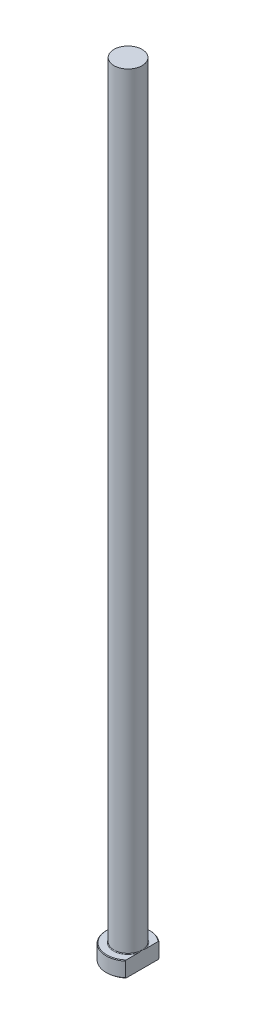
from build123d import *
from build123d.topology import SkipClean

# Parameters (mm, degrees)
CHAMFER1_SIZE = 0.2
FILLET1_R     = 0.2
KEY_DEPTH     = 251.195923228


with BuildPart() as part:
    # Sketch1 → Revolve1 (revolve)
    with BuildSketch(Plane.XY, mode=Mode.PRIVATE) as revolve1_sk:
        Polygon((0, 0), (-7, 0), (-7, 5), (-4.5, 5), (-4.5, 250), (0, 250), align=None)
    revolve(revolve1_sk.sketch.rotate(Axis((0, 259.958771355, 0), (0, -1, 0)), 270), axis=Axis((0, 259.958771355, 0), (0, -1, 0)))

    # Chamfer1
    chamfer1_edges = [part.edges().sort_by_distance(p)[0] for p in [
        (0, 5, -7),
        (0, 0, -7),
    ]]
    chamfer(chamfer1_edges, length=CHAMFER1_SIZE)

    # Fillet1
    fillet1_edges = [part.edges().sort_by_distance(p)[0] for p in [
        (0, 5, -4.5),
    ]]
    fillet(fillet1_edges, radius=FILLET1_R)

    # Sketch2 → KEY (cut, through all)
    with SkipClean():  # the faces are left unmerged after this step: merging them gives an invalid solid
        with BuildSketch(Plane(origin=(0, 0, 0), x_dir=(1, 0, 0), z_dir=(0, 1, 0))):
            with BuildLine():
                Line((4.5, 5.361902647), (4.5, -5.361902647))
                ThreePointArc((4.5, -5.361902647), (7, 0), (4.5, 5.361902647))
            make_face()
        extrude(amount=KEY_DEPTH, mode=Mode.SUBTRACT)


solid = part.part
